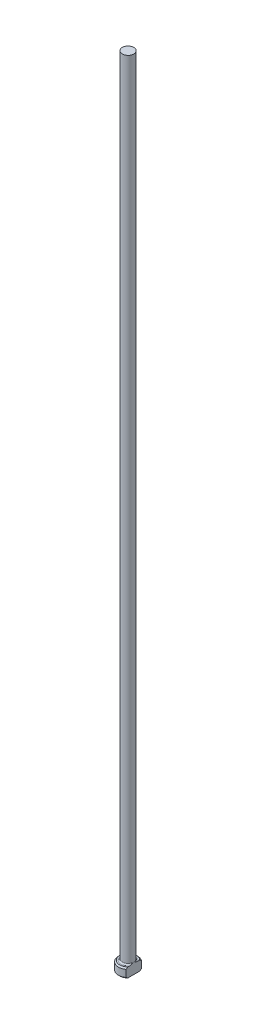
from build123d import *
from build123d.topology import SkipClean

# Parameters (mm, degrees)
CHAMFER1_SIZE = 0.2
FILLET1_R     = 0.2
KEY_DEPTH     = 126.017998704


with BuildPart() as part:
    # Sketch1 → Revolve1 (revolve)
    with BuildSketch(Plane.XY, mode=Mode.PRIVATE) as revolve1_sk:
        Polygon((0, 0), (-1.5, 0), (-1.5, 1.5), (-0.9, 1.5), (-0.9, 125), (0, 125), align=None)
    revolve(revolve1_sk.sketch.rotate(Axis((0, 259.958771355, 0), (0, -1, 0)), 270), axis=Axis((0, 259.958771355, 0), (0, -1, 0)))

    # Chamfer1
    chamfer1_edges = [part.edges().sort_by_distance(p)[0] for p in [
        (0, 1.5, -1.5),
        (0, 0, -1.5),
    ]]
    chamfer(chamfer1_edges, length=CHAMFER1_SIZE)

    # Fillet1
    fillet1_edges = [part.edges().sort_by_distance(p)[0] for p in [
        (0, 1.5, -0.9),
    ]]
    fillet(fillet1_edges, radius=FILLET1_R)

    # Sketch2 → KEY (cut, through all)
    with SkipClean():  # the faces are left unmerged after this step: merging them gives an invalid solid
        with BuildSketch(Plane(origin=(0, 0, 0), x_dir=(1, 0, 0), z_dir=(0, 1, 0))):
            with BuildLine():
                Line((0.9, 1.2), (0.9, -1.2))
                ThreePointArc((0.9, -1.2), (1.5, 0), (0.9, 1.2))
            make_face()
        extrude(amount=KEY_DEPTH, mode=Mode.SUBTRACT)


solid = part.part
